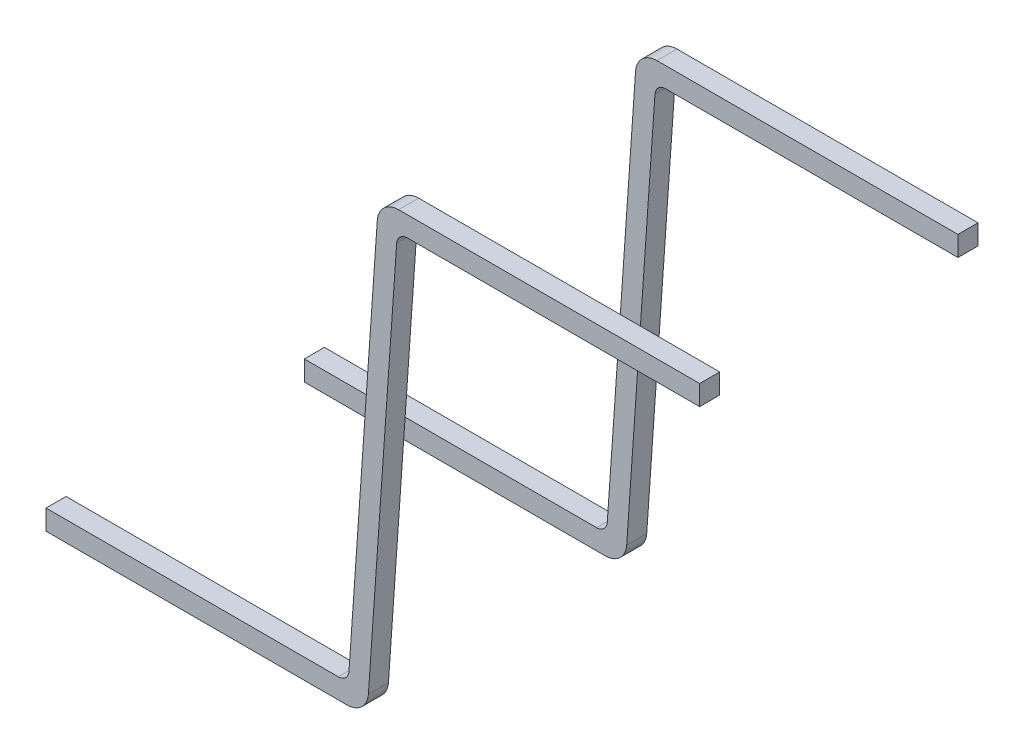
from build123d import *

# Parameters (mm, degrees)
BOSS_EXTRUDE1_START = 30.6578
BOSS_EXTRUDE1_DEPTH = 4.7625
BOSS_EXTRUDE2_START = -30.6578
BOSS_EXTRUDE2_DEPTH = 4.7625
FILLET1_R           = 2.54
FILLET2_R           = 2.54
FILLET3_R           = 5.08
FILLET4_R           = 5.08


with BuildPart() as part:
    # Sketch1 → Boss-Extrude1 (new body)
    with BuildSketch(Plane.XY.offset(BOSS_EXTRUDE1_START)):
        Polygon((0, 0), (7.215572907, 103.1875), (83.415572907, 103.1875), (83.415572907, 98.425), (11.656676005, 98.425), (4.441103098, -4.7625), (-71.758896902, -4.7625), (-71.758896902, 0), align=None)
    extrude(amount=BOSS_EXTRUDE1_DEPTH)

    # Fillet2
    fillet2_edges = [part.edges().sort_by_distance(p)[0] for p in [
        (0, 0, 33.03905),
        (11.656676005, 98.425, 33.03905),
    ]]
    fillet(fillet2_edges, radius=FILLET2_R)

    # Fillet3
    fillet3_edges = [part.edges().sort_by_distance(p)[0] for p in [
        (7.215572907, 103.1875, 33.03905),
        (4.441103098, -4.7625, 33.03905),
    ]]
    fillet(fillet3_edges, radius=FILLET3_R)


with BuildPart() as body_2:
    # Sketch1_2 → Boss-Extrude2 (new body)
    with BuildSketch(Plane.XY.offset(BOSS_EXTRUDE2_START)):
        Polygon((0, 0), (7.215572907, 103.1875), (83.415572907, 103.1875), (83.415572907, 98.425), (11.656676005, 98.425), (4.441103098, -4.7625), (-71.758896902, -4.7625), (-71.758896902, 0), align=None)
    extrude(amount=BOSS_EXTRUDE2_DEPTH)

    # Fillet1
    fillet1_edges = [body_2.edges().sort_by_distance(p)[0] for p in [
        (0, 0, -28.27655),
        (11.656676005, 98.425, -28.27655),
    ]]
    fillet(fillet1_edges, radius=FILLET1_R)

    # Fillet4
    fillet4_edges = [body_2.edges().sort_by_distance(p)[0] for p in [
        (7.215572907, 103.1875, -28.27655),
        (4.441103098, -4.7625, -28.27655),
    ]]
    fillet(fillet4_edges, radius=FILLET4_R)


solid = Compound([part.part, body_2.part])
